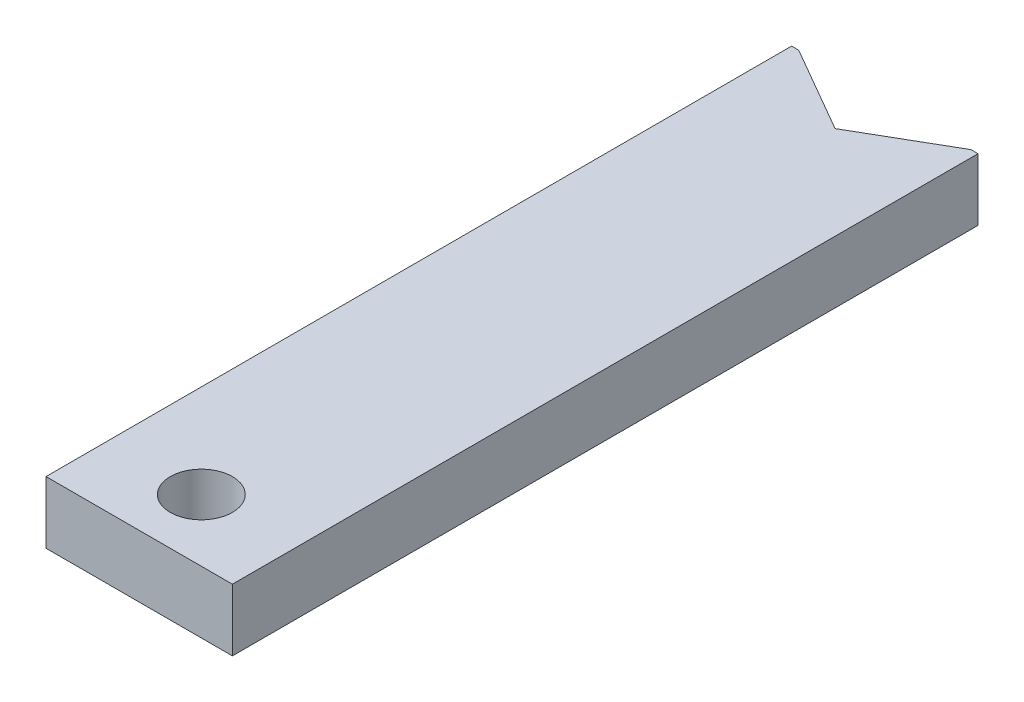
ISO-10303-21;
HEADER;
FILE_DESCRIPTION(('STEP AP214'),'2;1');
FILE_NAME('part.step','',(''),(''),'','','');
FILE_SCHEMA(('AUTOMOTIVE_DESIGN { 1 0 10303 214 1 1 1 1 }'));
ENDSEC;
DATA;
#1=APPLICATION_CONTEXT('core data for automotive mechanical design processes');
#2=APPLICATION_PROTOCOL_DEFINITION('international standard','automotive_design',2000,#1);
#3=PRODUCT_CONTEXT('',#1,'mechanical');
#4=PRODUCT('Part','Part','',(#3));
#5=PRODUCT_RELATED_PRODUCT_CATEGORY('part','',(#4));
#6=PRODUCT_DEFINITION_FORMATION('','',#4);
#7=PRODUCT_DEFINITION_CONTEXT('part definition',#1,'design');
#8=PRODUCT_DEFINITION('design','',#6,#7);
#9=PRODUCT_DEFINITION_SHAPE('','',#8);
#10=(LENGTH_UNIT() NAMED_UNIT(*) SI_UNIT(.MILLI.,.METRE.));
#11=(NAMED_UNIT(*) PLANE_ANGLE_UNIT() SI_UNIT($,.RADIAN.));
#12=(NAMED_UNIT(*) SI_UNIT($,.STERADIAN.) SOLID_ANGLE_UNIT());
#13=UNCERTAINTY_MEASURE_WITH_UNIT(LENGTH_MEASURE(1.E-05),#10,'distance_accuracy_value','');
#14=(GEOMETRIC_REPRESENTATION_CONTEXT(3) GLOBAL_UNCERTAINTY_ASSIGNED_CONTEXT((#13)) GLOBAL_UNIT_ASSIGNED_CONTEXT((#10,
#11,#12)) REPRESENTATION_CONTEXT('',''));
#15=CARTESIAN_POINT('',(0.,0.,0.));
#16=DIRECTION('',(0.,0.,1.));
#17=DIRECTION('',(1.,0.,0.));
#18=AXIS2_PLACEMENT_3D('',#15,#16,#17);
#19=CARTESIAN_POINT('',(-7.50000000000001,5.,-30.));
#20=DIRECTION('',(0.,0.,1.));
#21=DIRECTION('',(1.,0.,0.));
#22=AXIS2_PLACEMENT_3D('',#19,#20,#21);
#23=PLANE('',#22);
#24=DIRECTION('',(0.,1.,0.));
#25=VECTOR('',#24,1.);
#26=CARTESIAN_POINT('',(-6.92820323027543,0.,-30.));
#27=LINE('',#26,#25);
#28=CARTESIAN_POINT('',(-6.92820323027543,5.,-30.));
#29=VERTEX_POINT('',#28);
#30=CARTESIAN_POINT('',(-6.92820323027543,0.,-30.));
#31=VERTEX_POINT('',#30);
#32=EDGE_CURVE('E71',#29,#31,#27,.F.);
#33=ORIENTED_EDGE('',*,*,#32,.T.);
#34=DIRECTION('',(1.,0.,0.));
#35=VECTOR('',#34,1.);
#36=CARTESIAN_POINT('',(0.,0.,-30.));
#37=LINE('',#36,#35);
#38=CARTESIAN_POINT('',(-7.50000000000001,0.,-30.));
#39=VERTEX_POINT('',#38);
#40=EDGE_CURVE('E85',#31,#39,#37,.F.);
#41=ORIENTED_EDGE('',*,*,#40,.T.);
#42=DIRECTION('',(0.,1.,0.));
#43=VECTOR('',#42,1.);
#44=CARTESIAN_POINT('',(-7.50000000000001,5.,-30.));
#45=LINE('',#44,#43);
#46=CARTESIAN_POINT('',(-7.50000000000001,5.,-30.));
#47=VERTEX_POINT('',#46);
#48=EDGE_CURVE('E128',#39,#47,#45,.T.);
#49=ORIENTED_EDGE('',*,*,#48,.T.);
#50=DIRECTION('',(1.,0.,0.));
#51=VECTOR('',#50,1.);
#52=CARTESIAN_POINT('',(-7.50000000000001,5.,-30.));
#53=LINE('',#52,#51);
#54=EDGE_CURVE('E105',#29,#47,#53,.F.);
#55=ORIENTED_EDGE('',*,*,#54,.F.);
#56=EDGE_LOOP('',(#33,#41,#49,#55));
#57=FACE_BOUND('',#56,.T.);
#58=ADVANCED_FACE('F17',(#57),#23,.F.);
#59=CARTESIAN_POINT('',(-7.50000000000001,5.,-30.));
#60=DIRECTION('',(0.,0.,1.));
#61=DIRECTION('',(1.,0.,0.));
#62=AXIS2_PLACEMENT_3D('',#59,#60,#61);
#63=PLANE('',#62);
#64=DIRECTION('',(0.,1.,0.));
#65=VECTOR('',#64,1.);
#66=CARTESIAN_POINT('',(6.92820323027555,0.,-30.));
#67=LINE('',#66,#65);
#68=CARTESIAN_POINT('',(6.92820323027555,0.,-30.));
#69=VERTEX_POINT('',#68);
#70=CARTESIAN_POINT('',(6.92820323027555,5.,-30.));
#71=VERTEX_POINT('',#70);
#72=EDGE_CURVE('E79',#69,#71,#67,.T.);
#73=ORIENTED_EDGE('',*,*,#72,.T.);
#74=DIRECTION('',(1.,0.,0.));
#75=VECTOR('',#74,1.);
#76=CARTESIAN_POINT('',(-7.50000000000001,5.,-30.));
#77=LINE('',#76,#75);
#78=CARTESIAN_POINT('',(7.49999999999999,5.,-30.));
#79=VERTEX_POINT('',#78);
#80=EDGE_CURVE('E35',#79,#71,#77,.F.);
#81=ORIENTED_EDGE('',*,*,#80,.F.);
#82=DIRECTION('',(0.,1.,0.));
#83=VECTOR('',#82,1.);
#84=CARTESIAN_POINT('',(7.49999999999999,5.,-30.));
#85=LINE('',#84,#83);
#86=CARTESIAN_POINT('',(7.49999999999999,0.,-30.));
#87=VERTEX_POINT('',#86);
#88=EDGE_CURVE('E81',#79,#87,#85,.F.);
#89=ORIENTED_EDGE('',*,*,#88,.T.);
#90=DIRECTION('',(1.,0.,0.));
#91=VECTOR('',#90,1.);
#92=CARTESIAN_POINT('',(0.,0.,-30.));
#93=LINE('',#92,#91);
#94=EDGE_CURVE('E75',#87,#69,#93,.F.);
#95=ORIENTED_EDGE('',*,*,#94,.T.);
#96=EDGE_LOOP('',(#73,#81,#89,#95));
#97=FACE_BOUND('',#96,.T.);
#98=ADVANCED_FACE('F77',(#97),#63,.F.);
#99=CARTESIAN_POINT('',(0.,0.,0.));
#100=DIRECTION('',(0.,1.,0.));
#101=DIRECTION('',(0.,0.,1.));
#102=AXIS2_PLACEMENT_3D('',#99,#100,#101);
#103=PLANE('',#102);
#104=DIRECTION('',(0.86602540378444,0.,-0.499999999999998));
#105=VECTOR('',#104,1.);
#106=CARTESIAN_POINT('',(0.,0.,-26.));
#107=LINE('',#106,#105);
#108=CARTESIAN_POINT('',(0.,0.,-26.));
#109=VERTEX_POINT('',#108);
#110=EDGE_CURVE('E88',#109,#69,#107,.T.);
#111=ORIENTED_EDGE('',*,*,#110,.T.);
#112=ORIENTED_EDGE('',*,*,#94,.F.);
#113=DIRECTION('',(0.,0.,1.));
#114=VECTOR('',#113,1.);
#115=CARTESIAN_POINT('',(7.49999999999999,0.,-30.));
#116=LINE('',#115,#114);
#117=CARTESIAN_POINT('',(7.5,0.,30.));
#118=VERTEX_POINT('',#117);
#119=EDGE_CURVE('E108',#87,#118,#116,.T.);
#120=ORIENTED_EDGE('',*,*,#119,.T.);
#121=DIRECTION('',(-1.,0.,0.));
#122=VECTOR('',#121,1.);
#123=CARTESIAN_POINT('',(-7.5,0.,30.));
#124=LINE('',#123,#122);
#125=CARTESIAN_POINT('',(-7.5,0.,30.));
#126=VERTEX_POINT('',#125);
#127=EDGE_CURVE('E121',#118,#126,#124,.T.);
#128=ORIENTED_EDGE('',*,*,#127,.T.);
#129=DIRECTION('',(0.,0.,-1.));
#130=VECTOR('',#129,1.);
#131=CARTESIAN_POINT('',(-7.50000000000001,0.,-30.));
#132=LINE('',#131,#130);
#133=EDGE_CURVE('E125',#126,#39,#132,.T.);
#134=ORIENTED_EDGE('',*,*,#133,.T.);
#135=ORIENTED_EDGE('',*,*,#40,.F.);
#136=DIRECTION('',(0.866025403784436,0.,0.500000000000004));
#137=VECTOR('',#136,1.);
#138=CARTESIAN_POINT('',(-6.92820323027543,0.,-30.));
#139=LINE('',#138,#137);
#140=EDGE_CURVE('E92',#31,#109,#139,.T.);
#141=ORIENTED_EDGE('',*,*,#140,.T.);
#142=EDGE_LOOP('',(#111,#112,#120,#128,#134,#135,#141));
#143=FACE_BOUND('',#142,.T.);
#144=CARTESIAN_POINT('',(0.,0.,25.));
#145=DIRECTION('',(0.,1.,0.));
#146=DIRECTION('',(0.,0.,1.));
#147=AXIS2_PLACEMENT_3D('',#144,#145,#146);
#148=CIRCLE('',#147,2.50000000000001);
#149=CARTESIAN_POINT('',(0.,0.,27.5));
#150=VERTEX_POINT('',#149);
#151=EDGE_CURVE('E20',#150,#150,#148,.T.);
#152=ORIENTED_EDGE('',*,*,#151,.T.);
#153=EDGE_LOOP('',(#152));
#154=FACE_BOUND('',#153,.T.);
#155=ADVANCED_FACE('F89',(#143,#154),#103,.F.);
#156=CARTESIAN_POINT('',(0.,0.,25.));
#157=DIRECTION('',(0.,1.,0.));
#158=DIRECTION('',(0.,0.,1.));
#159=AXIS2_PLACEMENT_3D('',#156,#157,#158);
#160=CYLINDRICAL_SURFACE('',#159,2.50000000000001);
#161=CARTESIAN_POINT('',(0.,5.,25.));
#162=DIRECTION('',(0.,1.,0.));
#163=DIRECTION('',(0.,0.,1.));
#164=AXIS2_PLACEMENT_3D('',#161,#162,#163);
#165=CIRCLE('',#164,2.50000000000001);
#166=CARTESIAN_POINT('',(0.,5.,27.5));
#167=VERTEX_POINT('',#166);
#168=EDGE_CURVE('E106',#167,#167,#165,.F.);
#169=ORIENTED_EDGE('',*,*,#168,.F.);
#170=EDGE_LOOP('',(#169));
#171=FACE_BOUND('',#170,.T.);
#172=ORIENTED_EDGE('',*,*,#151,.F.);
#173=EDGE_LOOP('',(#172));
#174=FACE_BOUND('',#173,.T.);
#175=ADVANCED_FACE('F174',(#171,#174),#160,.F.);
#176=CARTESIAN_POINT('',(0.,0.,-26.));
#177=DIRECTION('',(0.499999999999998,0.,0.86602540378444));
#178=DIRECTION('',(0.86602540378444,0.,-0.499999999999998));
#179=AXIS2_PLACEMENT_3D('',#176,#177,#178);
#180=PLANE('',#179);
#181=ORIENTED_EDGE('',*,*,#72,.F.);
#182=ORIENTED_EDGE('',*,*,#110,.F.);
#183=DIRECTION('',(0.,1.,0.));
#184=VECTOR('',#183,1.);
#185=CARTESIAN_POINT('',(0.,0.,-26.));
#186=LINE('',#185,#184);
#187=CARTESIAN_POINT('',(0.,5.,-26.));
#188=VERTEX_POINT('',#187);
#189=EDGE_CURVE('E131',#109,#188,#186,.T.);
#190=ORIENTED_EDGE('',*,*,#189,.T.);
#191=DIRECTION('',(-0.86602540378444,0.,0.499999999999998));
#192=VECTOR('',#191,1.);
#193=CARTESIAN_POINT('',(6.92820323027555,5.,-30.));
#194=LINE('',#193,#192);
#195=EDGE_CURVE('E98',#71,#188,#194,.T.);
#196=ORIENTED_EDGE('',*,*,#195,.F.);
#197=EDGE_LOOP('',(#181,#182,#190,#196));
#198=FACE_BOUND('',#197,.T.);
#199=ADVANCED_FACE('F96',(#198),#180,.F.);
#200=CARTESIAN_POINT('',(-6.92820323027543,0.,-30.));
#201=DIRECTION('',(-0.500000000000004,0.,0.866025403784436));
#202=DIRECTION('',(0.866025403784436,0.,0.500000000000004));
#203=AXIS2_PLACEMENT_3D('',#200,#201,#202);
#204=PLANE('',#203);
#205=ORIENTED_EDGE('',*,*,#189,.F.);
#206=ORIENTED_EDGE('',*,*,#140,.F.);
#207=ORIENTED_EDGE('',*,*,#32,.F.);
#208=DIRECTION('',(-0.866025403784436,0.,-0.500000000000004));
#209=VECTOR('',#208,1.);
#210=CARTESIAN_POINT('',(0.,5.,-26.));
#211=LINE('',#210,#209);
#212=EDGE_CURVE('E111',#188,#29,#211,.T.);
#213=ORIENTED_EDGE('',*,*,#212,.F.);
#214=EDGE_LOOP('',(#205,#206,#207,#213));
#215=FACE_BOUND('',#214,.T.);
#216=ADVANCED_FACE('F135',(#215),#204,.F.);
#217=CARTESIAN_POINT('',(-7.50000000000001,5.,-30.));
#218=DIRECTION('',(1.,0.,0.));
#219=DIRECTION('',(0.,0.,-1.));
#220=AXIS2_PLACEMENT_3D('',#217,#218,#219);
#221=PLANE('',#220);
#222=DIRECTION('',(0.,1.,0.));
#223=VECTOR('',#222,1.);
#224=CARTESIAN_POINT('',(-7.5,5.,30.));
#225=LINE('',#224,#223);
#226=CARTESIAN_POINT('',(-7.5,5.,30.));
#227=VERTEX_POINT('',#226);
#228=EDGE_CURVE('E123',#126,#227,#225,.T.);
#229=ORIENTED_EDGE('',*,*,#228,.T.);
#230=DIRECTION('',(0.,0.,1.));
#231=VECTOR('',#230,1.);
#232=CARTESIAN_POINT('',(-7.50000000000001,5.,0.));
#233=LINE('',#232,#231);
#234=EDGE_CURVE('E137',#47,#227,#233,.T.);
#235=ORIENTED_EDGE('',*,*,#234,.F.);
#236=ORIENTED_EDGE('',*,*,#48,.F.);
#237=ORIENTED_EDGE('',*,*,#133,.F.);
#238=EDGE_LOOP('',(#229,#235,#236,#237));
#239=FACE_BOUND('',#238,.T.);
#240=ADVANCED_FACE('F151',(#239),#221,.F.);
#241=CARTESIAN_POINT('',(-7.5,5.,30.));
#242=DIRECTION('',(0.,0.,-1.));
#243=DIRECTION('',(-1.,0.,0.));
#244=AXIS2_PLACEMENT_3D('',#241,#242,#243);
#245=PLANE('',#244);
#246=DIRECTION('',(0.,1.,0.));
#247=VECTOR('',#246,1.);
#248=CARTESIAN_POINT('',(7.5,5.,30.));
#249=LINE('',#248,#247);
#250=CARTESIAN_POINT('',(7.5,5.,30.));
#251=VERTEX_POINT('',#250);
#252=EDGE_CURVE('E116',#118,#251,#249,.T.);
#253=ORIENTED_EDGE('',*,*,#252,.T.);
#254=DIRECTION('',(1.,0.,0.));
#255=VECTOR('',#254,1.);
#256=CARTESIAN_POINT('',(0.,5.,30.));
#257=LINE('',#256,#255);
#258=EDGE_CURVE('E26',#227,#251,#257,.T.);
#259=ORIENTED_EDGE('',*,*,#258,.F.);
#260=ORIENTED_EDGE('',*,*,#228,.F.);
#261=ORIENTED_EDGE('',*,*,#127,.F.);
#262=EDGE_LOOP('',(#253,#259,#260,#261));
#263=FACE_BOUND('',#262,.T.);
#264=ADVANCED_FACE('F146',(#263),#245,.F.);
#265=CARTESIAN_POINT('',(7.49999999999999,5.,-30.));
#266=DIRECTION('',(-1.,0.,0.));
#267=DIRECTION('',(0.,0.,1.));
#268=AXIS2_PLACEMENT_3D('',#265,#266,#267);
#269=PLANE('',#268);
#270=ORIENTED_EDGE('',*,*,#88,.F.);
#271=DIRECTION('',(0.,0.,1.));
#272=VECTOR('',#271,1.);
#273=CARTESIAN_POINT('',(7.5,5.,0.));
#274=LINE('',#273,#272);
#275=EDGE_CURVE('E11',#251,#79,#274,.F.);
#276=ORIENTED_EDGE('',*,*,#275,.F.);
#277=ORIENTED_EDGE('',*,*,#252,.F.);
#278=ORIENTED_EDGE('',*,*,#119,.F.);
#279=EDGE_LOOP('',(#270,#276,#277,#278));
#280=FACE_BOUND('',#279,.T.);
#281=ADVANCED_FACE('F144',(#280),#269,.F.);
#282=CARTESIAN_POINT('',(0.,5.,0.));
#283=DIRECTION('',(0.,1.,0.));
#284=DIRECTION('',(0.,0.,1.));
#285=AXIS2_PLACEMENT_3D('',#282,#283,#284);
#286=PLANE('',#285);
#287=ORIENTED_EDGE('',*,*,#275,.T.);
#288=ORIENTED_EDGE('',*,*,#80,.T.);
#289=ORIENTED_EDGE('',*,*,#195,.T.);
#290=ORIENTED_EDGE('',*,*,#212,.T.);
#291=ORIENTED_EDGE('',*,*,#54,.T.);
#292=ORIENTED_EDGE('',*,*,#234,.T.);
#293=ORIENTED_EDGE('',*,*,#258,.T.);
#294=EDGE_LOOP('',(#287,#288,#289,#290,#291,#292,#293));
#295=FACE_BOUND('',#294,.T.);
#296=ORIENTED_EDGE('',*,*,#168,.T.);
#297=EDGE_LOOP('',(#296));
#298=FACE_BOUND('',#297,.T.);
#299=ADVANCED_FACE('F138',(#295,#298),#286,.T.);
#300=CLOSED_SHELL('',(#58,#98,#155,#175,#199,#216,#240,#264,#281,#299));
#301=MANIFOLD_SOLID_BREP('B1',#300);
#302=ADVANCED_BREP_SHAPE_REPRESENTATION('',(#18,#301),#14);
#303=SHAPE_DEFINITION_REPRESENTATION(#9,#302);
ENDSEC;
END-ISO-10303-21;
